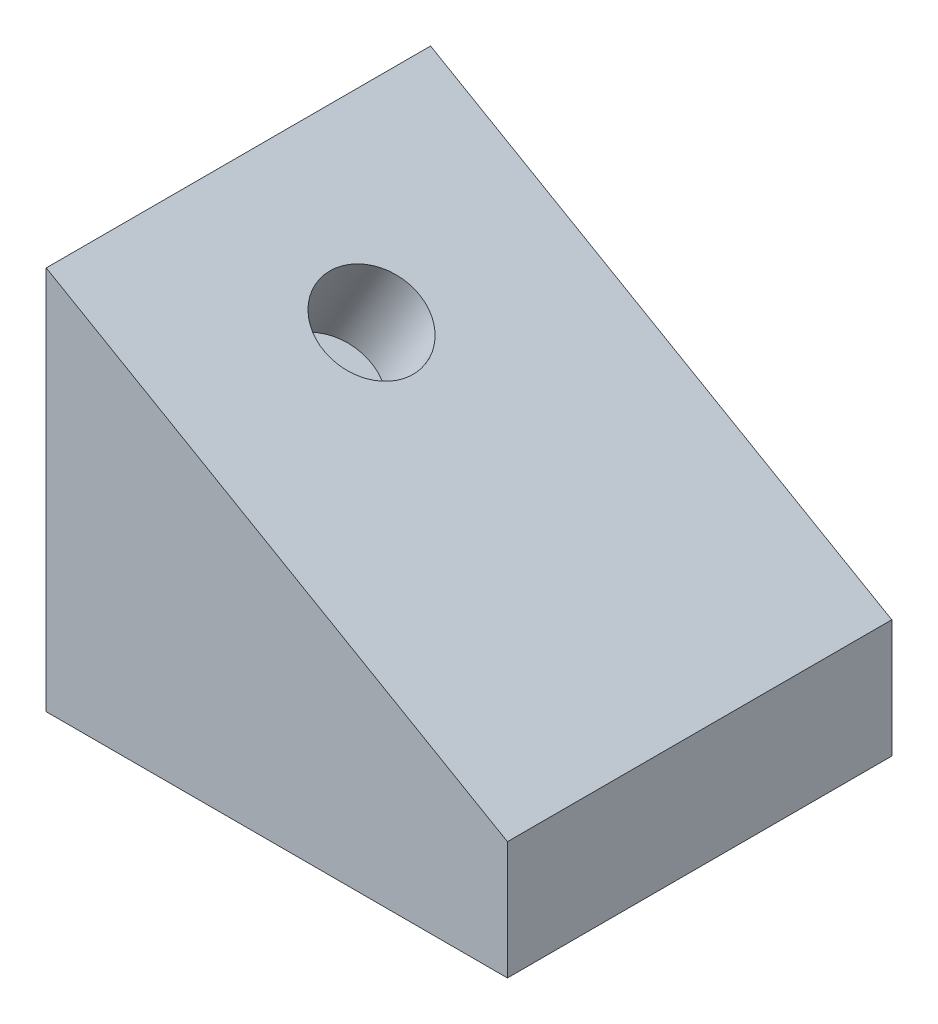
from build123d import *

# Parameters (mm, degrees)
BOSS_EXTRUDE1_DEPTH = 10
SKETCH2_R           = 2.5
CUT_EXTRUDE1_DEPTH  = 5
SKETCH3_R           = 2.5
CUT_EXTRUDE2_DEPTH  = 5


with BuildPart() as part:
    # Sketch1 → Boss-Extrude1 (new, symmetric)
    with BuildSketch(Plane.XY):
        Polygon((0, 0), (0, 20), (24, 6.143593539), (24, 0), align=None)
    extrude(amount=BOSS_EXTRUDE1_DEPTH, both=True)

    # Sketch2 → Cut-Extrude1 (cut)
    with BuildSketch(Plane.XZ):
        with Locations((14, 0)):
            Circle(SKETCH2_R)
    extrude(amount=-CUT_EXTRUDE1_DEPTH, mode=Mode.SUBTRACT)

    # Sketch3 → Cut-Extrude2 (cut)
    with BuildSketch(Plane(origin=(8.660254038, 15, 0), x_dir=(0.8660254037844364, -0.5000000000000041, 0), z_dir=(0.500000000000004, 0.8660254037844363, 0))):
        with Locations(Location((-2, 0, 0), (0, 0, 180))):
            Circle(SKETCH3_R)
    extrude(amount=-CUT_EXTRUDE2_DEPTH, mode=Mode.SUBTRACT)


solid = part.part
